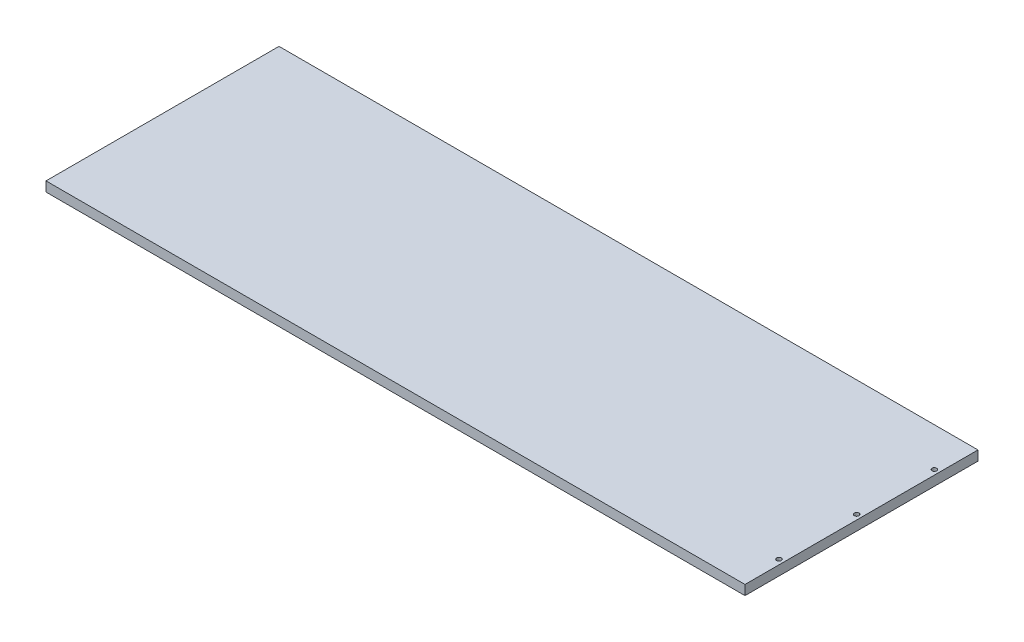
ISO-10303-21;
HEADER;
FILE_DESCRIPTION(('STEP AP214'),'2;1');
FILE_NAME('part.step','',(''),(''),'','','');
FILE_SCHEMA(('AUTOMOTIVE_DESIGN { 1 0 10303 214 1 1 1 1 }'));
ENDSEC;
DATA;
#1=APPLICATION_CONTEXT('core data for automotive mechanical design processes');
#2=APPLICATION_PROTOCOL_DEFINITION('international standard','automotive_design',2000,#1);
#3=PRODUCT_CONTEXT('',#1,'mechanical');
#4=PRODUCT('Part','Part','',(#3));
#5=PRODUCT_RELATED_PRODUCT_CATEGORY('part','',(#4));
#6=PRODUCT_DEFINITION_FORMATION('','',#4);
#7=PRODUCT_DEFINITION_CONTEXT('part definition',#1,'design');
#8=PRODUCT_DEFINITION('design','',#6,#7);
#9=PRODUCT_DEFINITION_SHAPE('','',#8);
#10=(LENGTH_UNIT() NAMED_UNIT(*) SI_UNIT(.MILLI.,.METRE.));
#11=(NAMED_UNIT(*) PLANE_ANGLE_UNIT() SI_UNIT($,.RADIAN.));
#12=(NAMED_UNIT(*) SI_UNIT($,.STERADIAN.) SOLID_ANGLE_UNIT());
#13=UNCERTAINTY_MEASURE_WITH_UNIT(LENGTH_MEASURE(1.E-05),#10,'distance_accuracy_value','');
#14=(GEOMETRIC_REPRESENTATION_CONTEXT(3) GLOBAL_UNCERTAINTY_ASSIGNED_CONTEXT((#13)) GLOBAL_UNIT_ASSIGNED_CONTEXT((#10,
#11,#12)) REPRESENTATION_CONTEXT('',''));
#15=CARTESIAN_POINT('',(0.,0.,0.));
#16=DIRECTION('',(0.,0.,1.));
#17=DIRECTION('',(1.,0.,0.));
#18=AXIS2_PLACEMENT_3D('',#15,#16,#17);
#19=CARTESIAN_POINT('',(228.6,6.35,76.2));
#20=DIRECTION('',(-1.,0.,0.));
#21=DIRECTION('',(0.,0.,1.));
#22=AXIS2_PLACEMENT_3D('',#19,#20,#21);
#23=PLANE('',#22);
#24=DIRECTION('',(0.,0.,-1.));
#25=VECTOR('',#24,1.);
#26=CARTESIAN_POINT('',(228.6,0.,76.2));
#27=LINE('',#26,#25);
#28=CARTESIAN_POINT('',(228.6,0.,76.2));
#29=VERTEX_POINT('',#28);
#30=CARTESIAN_POINT('',(228.6,0.,-76.2));
#31=VERTEX_POINT('',#30);
#32=EDGE_CURVE('E129',#29,#31,#27,.T.);
#33=ORIENTED_EDGE('',*,*,#32,.T.);
#34=DIRECTION('',(0.,-1.,0.));
#35=VECTOR('',#34,1.);
#36=CARTESIAN_POINT('',(228.6,6.35,-76.2));
#37=LINE('',#36,#35);
#38=CARTESIAN_POINT('',(228.6,6.35,-76.2));
#39=VERTEX_POINT('',#38);
#40=EDGE_CURVE('E11',#39,#31,#37,.T.);
#41=ORIENTED_EDGE('',*,*,#40,.F.);
#42=DIRECTION('',(0.,0.,-1.));
#43=VECTOR('',#42,1.);
#44=CARTESIAN_POINT('',(228.6,6.35,76.2));
#45=LINE('',#44,#43);
#46=CARTESIAN_POINT('',(228.6,6.35,76.2));
#47=VERTEX_POINT('',#46);
#48=EDGE_CURVE('E130',#47,#39,#45,.T.);
#49=ORIENTED_EDGE('',*,*,#48,.F.);
#50=DIRECTION('',(0.,-1.,0.));
#51=VECTOR('',#50,1.);
#52=CARTESIAN_POINT('',(228.6,6.35,76.2));
#53=LINE('',#52,#51);
#54=EDGE_CURVE('E136',#47,#29,#53,.T.);
#55=ORIENTED_EDGE('',*,*,#54,.T.);
#56=EDGE_LOOP('',(#33,#41,#49,#55));
#57=FACE_BOUND('',#56,.T.);
#58=ADVANCED_FACE('F43',(#57),#23,.F.);
#59=CARTESIAN_POINT('',(-228.6,6.35,-76.2));
#60=DIRECTION('',(0.,0.,1.));
#61=DIRECTION('',(1.,0.,0.));
#62=AXIS2_PLACEMENT_3D('',#59,#60,#61);
#63=PLANE('',#62);
#64=DIRECTION('',(-1.,0.,0.));
#65=VECTOR('',#64,1.);
#66=CARTESIAN_POINT('',(-228.6,0.,-76.2));
#67=LINE('',#66,#65);
#68=CARTESIAN_POINT('',(-228.6,0.,-76.2));
#69=VERTEX_POINT('',#68);
#70=EDGE_CURVE('E139',#31,#69,#67,.T.);
#71=ORIENTED_EDGE('',*,*,#70,.T.);
#72=DIRECTION('',(0.,-1.,0.));
#73=VECTOR('',#72,1.);
#74=CARTESIAN_POINT('',(-228.6,6.35,-76.2));
#75=LINE('',#74,#73);
#76=CARTESIAN_POINT('',(-228.6,6.35,-76.2));
#77=VERTEX_POINT('',#76);
#78=EDGE_CURVE('E51',#77,#69,#75,.T.);
#79=ORIENTED_EDGE('',*,*,#78,.F.);
#80=DIRECTION('',(-1.,0.,0.));
#81=VECTOR('',#80,1.);
#82=CARTESIAN_POINT('',(-228.6,6.35,-76.2));
#83=LINE('',#82,#81);
#84=EDGE_CURVE('E90',#39,#77,#83,.T.);
#85=ORIENTED_EDGE('',*,*,#84,.F.);
#86=ORIENTED_EDGE('',*,*,#40,.T.);
#87=EDGE_LOOP('',(#71,#79,#85,#86));
#88=FACE_BOUND('',#87,.T.);
#89=ADVANCED_FACE('F163',(#88),#63,.F.);
#90=CARTESIAN_POINT('',(-228.6,6.35,76.2));
#91=DIRECTION('',(1.,0.,0.));
#92=DIRECTION('',(0.,0.,-1.));
#93=AXIS2_PLACEMENT_3D('',#90,#91,#92);
#94=PLANE('',#93);
#95=CARTESIAN_POINT('',(-228.6,3.175,0.));
#96=DIRECTION('',(-1.,0.,0.));
#97=DIRECTION('',(0.,0.,1.));
#98=AXIS2_PLACEMENT_3D('',#95,#96,#97);
#99=CIRCLE('',#98,1.13029999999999);
#100=CARTESIAN_POINT('',(-228.6,3.175,1.13029999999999));
#101=VERTEX_POINT('',#100);
#102=EDGE_CURVE('E111',#101,#101,#99,.T.);
#103=ORIENTED_EDGE('',*,*,#102,.F.);
#104=EDGE_LOOP('',(#103));
#105=FACE_BOUND('',#104,.T.);
#106=CARTESIAN_POINT('',(-228.6,3.175,50.8));
#107=DIRECTION('',(-1.,0.,0.));
#108=DIRECTION('',(0.,0.,1.));
#109=AXIS2_PLACEMENT_3D('',#106,#107,#108);
#110=CIRCLE('',#109,1.13029999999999);
#111=CARTESIAN_POINT('',(-228.6,3.175,51.9303));
#112=VERTEX_POINT('',#111);
#113=EDGE_CURVE('E110',#112,#112,#110,.T.);
#114=ORIENTED_EDGE('',*,*,#113,.F.);
#115=EDGE_LOOP('',(#114));
#116=FACE_BOUND('',#115,.T.);
#117=CARTESIAN_POINT('',(-228.6,3.175,-50.8));
#118=DIRECTION('',(-1.,0.,0.));
#119=DIRECTION('',(0.,0.,1.));
#120=AXIS2_PLACEMENT_3D('',#117,#118,#119);
#121=CIRCLE('',#120,1.13029999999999);
#122=CARTESIAN_POINT('',(-228.6,3.175,-49.6697));
#123=VERTEX_POINT('',#122);
#124=EDGE_CURVE('E123',#123,#123,#121,.T.);
#125=ORIENTED_EDGE('',*,*,#124,.F.);
#126=EDGE_LOOP('',(#125));
#127=FACE_BOUND('',#126,.T.);
#128=DIRECTION('',(0.,0.,1.));
#129=VECTOR('',#128,1.);
#130=CARTESIAN_POINT('',(-228.6,0.,76.2));
#131=LINE('',#130,#129);
#132=CARTESIAN_POINT('',(-228.6,0.,76.2));
#133=VERTEX_POINT('',#132);
#134=EDGE_CURVE('E77',#69,#133,#131,.T.);
#135=ORIENTED_EDGE('',*,*,#134,.T.);
#136=DIRECTION('',(0.,-1.,0.));
#137=VECTOR('',#136,1.);
#138=CARTESIAN_POINT('',(-228.6,6.35,76.2));
#139=LINE('',#138,#137);
#140=CARTESIAN_POINT('',(-228.6,6.35,76.2));
#141=VERTEX_POINT('',#140);
#142=EDGE_CURVE('E144',#141,#133,#139,.T.);
#143=ORIENTED_EDGE('',*,*,#142,.F.);
#144=DIRECTION('',(0.,0.,1.));
#145=VECTOR('',#144,1.);
#146=CARTESIAN_POINT('',(-228.6,6.35,76.2));
#147=LINE('',#146,#145);
#148=EDGE_CURVE('E133',#77,#141,#147,.T.);
#149=ORIENTED_EDGE('',*,*,#148,.F.);
#150=ORIENTED_EDGE('',*,*,#78,.T.);
#151=EDGE_LOOP('',(#135,#143,#149,#150));
#152=FACE_BOUND('',#151,.T.);
#153=ADVANCED_FACE('F146',(#105,#116,#127,#152),#94,.F.);
#154=CARTESIAN_POINT('',(-228.6,6.35,76.2));
#155=DIRECTION('',(0.,0.,-1.));
#156=DIRECTION('',(-1.,0.,0.));
#157=AXIS2_PLACEMENT_3D('',#154,#155,#156);
#158=PLANE('',#157);
#159=DIRECTION('',(1.,0.,0.));
#160=VECTOR('',#159,1.);
#161=CARTESIAN_POINT('',(-228.6,0.,76.2));
#162=LINE('',#161,#160);
#163=EDGE_CURVE('E83',#133,#29,#162,.T.);
#164=ORIENTED_EDGE('',*,*,#163,.T.);
#165=ORIENTED_EDGE('',*,*,#54,.F.);
#166=DIRECTION('',(1.,0.,0.));
#167=VECTOR('',#166,1.);
#168=CARTESIAN_POINT('',(-228.6,6.35,76.2));
#169=LINE('',#168,#167);
#170=EDGE_CURVE('E59',#141,#47,#169,.T.);
#171=ORIENTED_EDGE('',*,*,#170,.F.);
#172=ORIENTED_EDGE('',*,*,#142,.T.);
#173=EDGE_LOOP('',(#164,#165,#171,#172));
#174=FACE_BOUND('',#173,.T.);
#175=ADVANCED_FACE('F153',(#174),#158,.F.);
#176=CARTESIAN_POINT('',(0.,6.35,0.));
#177=DIRECTION('',(0.,-1.,0.));
#178=DIRECTION('',(0.,0.,-1.));
#179=AXIS2_PLACEMENT_3D('',#176,#177,#178);
#180=PLANE('',#179);
#181=CARTESIAN_POINT('',(225.425,6.35,0.));
#182=DIRECTION('',(0.,1.,0.));
#183=DIRECTION('',(0.,0.,1.));
#184=AXIS2_PLACEMENT_3D('',#181,#182,#183);
#185=CIRCLE('',#184,1.524);
#186=CARTESIAN_POINT('',(225.425,6.35,1.52399999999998));
#187=VERTEX_POINT('',#186);
#188=EDGE_CURVE('E366',#187,#187,#185,.T.);
#189=ORIENTED_EDGE('',*,*,#188,.F.);
#190=EDGE_LOOP('',(#189));
#191=FACE_BOUND('',#190,.T.);
#192=CARTESIAN_POINT('',(225.425,6.35,-50.8));
#193=DIRECTION('',(0.,1.,0.));
#194=DIRECTION('',(0.,0.,1.));
#195=AXIS2_PLACEMENT_3D('',#192,#193,#194);
#196=CIRCLE('',#195,1.524);
#197=CARTESIAN_POINT('',(225.425,6.35,-49.276));
#198=VERTEX_POINT('',#197);
#199=EDGE_CURVE('E362',#198,#198,#196,.T.);
#200=ORIENTED_EDGE('',*,*,#199,.F.);
#201=EDGE_LOOP('',(#200));
#202=FACE_BOUND('',#201,.T.);
#203=CARTESIAN_POINT('',(225.425,6.35,50.8));
#204=DIRECTION('',(0.,1.,0.));
#205=DIRECTION('',(0.,0.,1.));
#206=AXIS2_PLACEMENT_3D('',#203,#204,#205);
#207=CIRCLE('',#206,1.524);
#208=CARTESIAN_POINT('',(225.425,6.35,52.324));
#209=VERTEX_POINT('',#208);
#210=EDGE_CURVE('E357',#209,#209,#207,.T.);
#211=ORIENTED_EDGE('',*,*,#210,.F.);
#212=EDGE_LOOP('',(#211));
#213=FACE_BOUND('',#212,.T.);
#214=ORIENTED_EDGE('',*,*,#48,.T.);
#215=ORIENTED_EDGE('',*,*,#84,.T.);
#216=ORIENTED_EDGE('',*,*,#148,.T.);
#217=ORIENTED_EDGE('',*,*,#170,.T.);
#218=EDGE_LOOP('',(#214,#215,#216,#217));
#219=FACE_BOUND('',#218,.T.);
#220=ADVANCED_FACE('F155',(#191,#202,#213,#219),#180,.F.);
#221=CARTESIAN_POINT('',(0.,0.,0.));
#222=DIRECTION('',(0.,-1.,0.));
#223=DIRECTION('',(0.,0.,-1.));
#224=AXIS2_PLACEMENT_3D('',#221,#222,#223);
#225=PLANE('',#224);
#226=CARTESIAN_POINT('',(225.425,0.,0.));
#227=DIRECTION('',(0.,1.,0.));
#228=DIRECTION('',(0.,0.,1.));
#229=AXIS2_PLACEMENT_3D('',#226,#227,#228);
#230=CIRCLE('',#229,1.524);
#231=CARTESIAN_POINT('',(225.425,0.,1.52399999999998));
#232=VERTEX_POINT('',#231);
#233=EDGE_CURVE('E350',#232,#232,#230,.T.);
#234=ORIENTED_EDGE('',*,*,#233,.T.);
#235=EDGE_LOOP('',(#234));
#236=FACE_BOUND('',#235,.T.);
#237=CARTESIAN_POINT('',(225.425,0.,-50.8));
#238=DIRECTION('',(0.,1.,0.));
#239=DIRECTION('',(0.,0.,1.));
#240=AXIS2_PLACEMENT_3D('',#237,#238,#239);
#241=CIRCLE('',#240,1.524);
#242=CARTESIAN_POINT('',(225.425,0.,-49.276));
#243=VERTEX_POINT('',#242);
#244=EDGE_CURVE('E354',#243,#243,#241,.T.);
#245=ORIENTED_EDGE('',*,*,#244,.T.);
#246=EDGE_LOOP('',(#245));
#247=FACE_BOUND('',#246,.T.);
#248=CARTESIAN_POINT('',(225.425,0.,50.8));
#249=DIRECTION('',(0.,1.,0.));
#250=DIRECTION('',(0.,0.,1.));
#251=AXIS2_PLACEMENT_3D('',#248,#249,#250);
#252=CIRCLE('',#251,1.524);
#253=CARTESIAN_POINT('',(225.425,0.,52.324));
#254=VERTEX_POINT('',#253);
#255=EDGE_CURVE('E117',#254,#254,#252,.T.);
#256=ORIENTED_EDGE('',*,*,#255,.T.);
#257=EDGE_LOOP('',(#256));
#258=FACE_BOUND('',#257,.T.);
#259=ORIENTED_EDGE('',*,*,#32,.F.);
#260=ORIENTED_EDGE('',*,*,#163,.F.);
#261=ORIENTED_EDGE('',*,*,#134,.F.);
#262=ORIENTED_EDGE('',*,*,#70,.F.);
#263=EDGE_LOOP('',(#259,#260,#261,#262));
#264=FACE_BOUND('',#263,.T.);
#265=ADVANCED_FACE('F149',(#236,#247,#258,#264),#225,.T.);
#266=CARTESIAN_POINT('',(-220.98,3.175,-50.8));
#267=DIRECTION('',(-1.,0.,0.));
#268=DIRECTION('',(0.,0.,1.));
#269=AXIS2_PLACEMENT_3D('',#266,#267,#268);
#270=CONICAL_SURFACE('',#269,1.13029999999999,1.02974425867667);
#271=CARTESIAN_POINT('',(-220.300847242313,3.175,-50.8));
#272=VERTEX_POINT('',#271);
#273=VERTEX_LOOP('',#272);
#274=FACE_BOUND('',#273,.T.);
#275=CARTESIAN_POINT('',(-220.98,3.175,-50.8));
#276=DIRECTION('',(-1.,0.,0.));
#277=DIRECTION('',(0.,0.,1.));
#278=AXIS2_PLACEMENT_3D('',#275,#276,#277);
#279=CIRCLE('',#278,1.13029999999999);
#280=CARTESIAN_POINT('',(-220.98,3.175,-49.6697));
#281=VERTEX_POINT('',#280);
#282=EDGE_CURVE('E126',#281,#281,#279,.T.);
#283=ORIENTED_EDGE('',*,*,#282,.T.);
#284=EDGE_LOOP('',(#283));
#285=FACE_BOUND('',#284,.T.);
#286=ADVANCED_FACE('F189',(#274,#285),#270,.F.);
#287=CARTESIAN_POINT('',(-228.6,3.175,-50.8));
#288=DIRECTION('',(-1.,0.,0.));
#289=DIRECTION('',(0.,0.,1.));
#290=AXIS2_PLACEMENT_3D('',#287,#288,#289);
#291=CYLINDRICAL_SURFACE('',#290,1.13029999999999);
#292=ORIENTED_EDGE('',*,*,#282,.F.);
#293=EDGE_LOOP('',(#292));
#294=FACE_BOUND('',#293,.T.);
#295=ORIENTED_EDGE('',*,*,#124,.T.);
#296=EDGE_LOOP('',(#295));
#297=FACE_BOUND('',#296,.T.);
#298=ADVANCED_FACE('F183',(#294,#297),#291,.F.);
#299=CARTESIAN_POINT('',(-220.98,3.175,50.8));
#300=DIRECTION('',(-1.,0.,0.));
#301=DIRECTION('',(0.,0.,1.));
#302=AXIS2_PLACEMENT_3D('',#299,#300,#301);
#303=CONICAL_SURFACE('',#302,1.13029999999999,1.02974425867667);
#304=CARTESIAN_POINT('',(-220.300847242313,3.175,50.8));
#305=VERTEX_POINT('',#304);
#306=VERTEX_LOOP('',#305);
#307=FACE_BOUND('',#306,.T.);
#308=CARTESIAN_POINT('',(-220.98,3.175,50.8));
#309=DIRECTION('',(-1.,0.,0.));
#310=DIRECTION('',(0.,0.,1.));
#311=AXIS2_PLACEMENT_3D('',#308,#309,#310);
#312=CIRCLE('',#311,1.13029999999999);
#313=CARTESIAN_POINT('',(-220.98,3.175,51.9303));
#314=VERTEX_POINT('',#313);
#315=EDGE_CURVE('E114',#314,#314,#312,.T.);
#316=ORIENTED_EDGE('',*,*,#315,.T.);
#317=EDGE_LOOP('',(#316));
#318=FACE_BOUND('',#317,.T.);
#319=ADVANCED_FACE('F188',(#307,#318),#303,.F.);
#320=CARTESIAN_POINT('',(-228.6,3.175,50.8));
#321=DIRECTION('',(-1.,0.,0.));
#322=DIRECTION('',(0.,0.,1.));
#323=AXIS2_PLACEMENT_3D('',#320,#321,#322);
#324=CYLINDRICAL_SURFACE('',#323,1.13029999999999);
#325=ORIENTED_EDGE('',*,*,#315,.F.);
#326=EDGE_LOOP('',(#325));
#327=FACE_BOUND('',#326,.T.);
#328=ORIENTED_EDGE('',*,*,#113,.T.);
#329=EDGE_LOOP('',(#328));
#330=FACE_BOUND('',#329,.T.);
#331=ADVANCED_FACE('F104',(#327,#330),#324,.F.);
#332=CARTESIAN_POINT('',(-220.98,3.175,0.));
#333=DIRECTION('',(-1.,0.,0.));
#334=DIRECTION('',(0.,0.,1.));
#335=AXIS2_PLACEMENT_3D('',#332,#333,#334);
#336=CONICAL_SURFACE('',#335,1.13029999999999,1.02974425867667);
#337=CARTESIAN_POINT('',(-220.300847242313,3.175,0.));
#338=VERTEX_POINT('',#337);
#339=VERTEX_LOOP('',#338);
#340=FACE_BOUND('',#339,.T.);
#341=CARTESIAN_POINT('',(-220.98,3.175,0.));
#342=DIRECTION('',(-1.,0.,0.));
#343=DIRECTION('',(0.,0.,1.));
#344=AXIS2_PLACEMENT_3D('',#341,#342,#343);
#345=CIRCLE('',#344,1.13029999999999);
#346=CARTESIAN_POINT('',(-220.98,3.175,1.13029999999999));
#347=VERTEX_POINT('',#346);
#348=EDGE_CURVE('E108',#347,#347,#345,.T.);
#349=ORIENTED_EDGE('',*,*,#348,.T.);
#350=EDGE_LOOP('',(#349));
#351=FACE_BOUND('',#350,.T.);
#352=ADVANCED_FACE('F100',(#340,#351),#336,.F.);
#353=CARTESIAN_POINT('',(-228.6,3.175,0.));
#354=DIRECTION('',(-1.,0.,0.));
#355=DIRECTION('',(0.,0.,1.));
#356=AXIS2_PLACEMENT_3D('',#353,#354,#355);
#357=CYLINDRICAL_SURFACE('',#356,1.13029999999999);
#358=ORIENTED_EDGE('',*,*,#348,.F.);
#359=EDGE_LOOP('',(#358));
#360=FACE_BOUND('',#359,.T.);
#361=ORIENTED_EDGE('',*,*,#102,.T.);
#362=EDGE_LOOP('',(#361));
#363=FACE_BOUND('',#362,.T.);
#364=ADVANCED_FACE('F103',(#360,#363),#357,.F.);
#365=CARTESIAN_POINT('',(225.425,6.35,50.8));
#366=DIRECTION('',(0.,1.,0.));
#367=DIRECTION('',(0.,0.,1.));
#368=AXIS2_PLACEMENT_3D('',#365,#366,#367);
#369=CYLINDRICAL_SURFACE('',#368,1.524);
#370=ORIENTED_EDGE('',*,*,#255,.F.);
#371=EDGE_LOOP('',(#370));
#372=FACE_BOUND('',#371,.T.);
#373=ORIENTED_EDGE('',*,*,#210,.T.);
#374=EDGE_LOOP('',(#373));
#375=FACE_BOUND('',#374,.T.);
#376=ADVANCED_FACE('F211',(#372,#375),#369,.F.);
#377=CARTESIAN_POINT('',(225.425,6.35,-50.8));
#378=DIRECTION('',(0.,1.,0.));
#379=DIRECTION('',(0.,0.,1.));
#380=AXIS2_PLACEMENT_3D('',#377,#378,#379);
#381=CYLINDRICAL_SURFACE('',#380,1.524);
#382=ORIENTED_EDGE('',*,*,#244,.F.);
#383=EDGE_LOOP('',(#382));
#384=FACE_BOUND('',#383,.T.);
#385=ORIENTED_EDGE('',*,*,#199,.T.);
#386=EDGE_LOOP('',(#385));
#387=FACE_BOUND('',#386,.T.);
#388=ADVANCED_FACE('F222',(#384,#387),#381,.F.);
#389=CARTESIAN_POINT('',(225.425,6.35,0.));
#390=DIRECTION('',(0.,1.,0.));
#391=DIRECTION('',(0.,0.,1.));
#392=AXIS2_PLACEMENT_3D('',#389,#390,#391);
#393=CYLINDRICAL_SURFACE('',#392,1.524);
#394=ORIENTED_EDGE('',*,*,#233,.F.);
#395=EDGE_LOOP('',(#394));
#396=FACE_BOUND('',#395,.T.);
#397=ORIENTED_EDGE('',*,*,#188,.T.);
#398=EDGE_LOOP('',(#397));
#399=FACE_BOUND('',#398,.T.);
#400=ADVANCED_FACE('F231',(#396,#399),#393,.F.);
#401=CLOSED_SHELL('',(#58,#89,#153,#175,#220,#265,#286,#298,#319,#331,#352,#364,#376,#388,#400));
#402=MANIFOLD_SOLID_BREP('B2',#401);
#403=ADVANCED_BREP_SHAPE_REPRESENTATION('',(#18,#402),#14);
#404=SHAPE_DEFINITION_REPRESENTATION(#9,#403);
ENDSEC;
END-ISO-10303-21;
